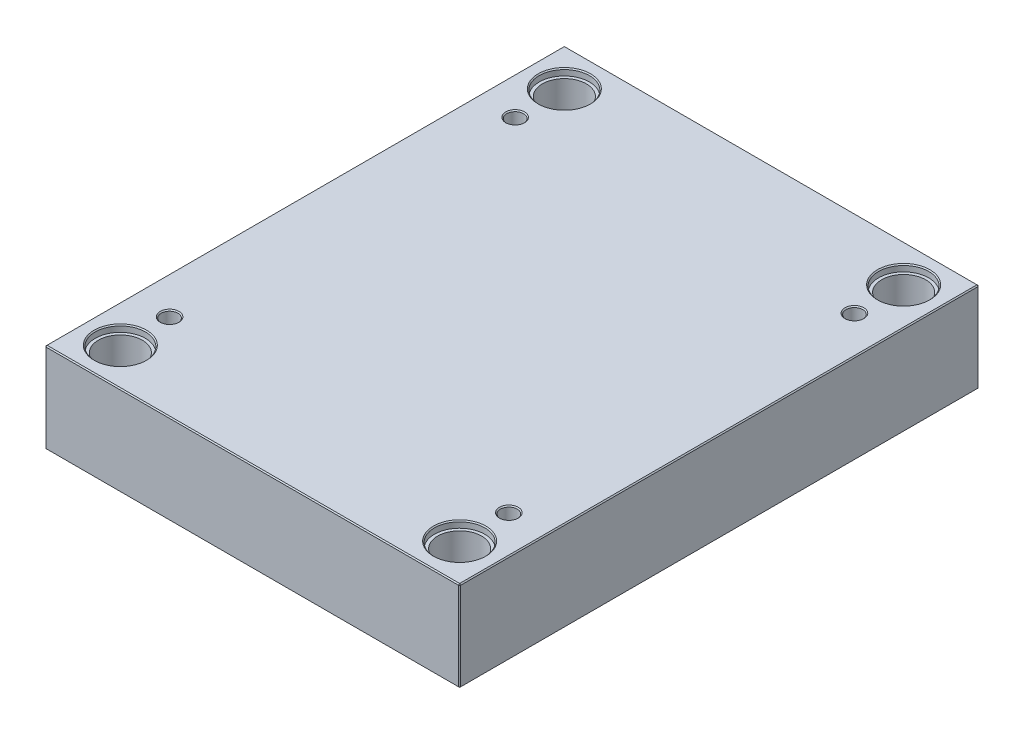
ISO-10303-21;
HEADER;
FILE_DESCRIPTION(('STEP AP214'),'2;1');
FILE_NAME('part.step','',(''),(''),'','','');
FILE_SCHEMA(('AUTOMOTIVE_DESIGN { 1 0 10303 214 1 1 1 1 }'));
ENDSEC;
DATA;
#1=APPLICATION_CONTEXT('core data for automotive mechanical design processes');
#2=APPLICATION_PROTOCOL_DEFINITION('international standard','automotive_design',2000,#1);
#3=PRODUCT_CONTEXT('',#1,'mechanical');
#4=PRODUCT('Part','Part','',(#3));
#5=PRODUCT_RELATED_PRODUCT_CATEGORY('part','',(#4));
#6=PRODUCT_DEFINITION_FORMATION('','',#4);
#7=PRODUCT_DEFINITION_CONTEXT('part definition',#1,'design');
#8=PRODUCT_DEFINITION('design','',#6,#7);
#9=PRODUCT_DEFINITION_SHAPE('','',#8);
#10=(LENGTH_UNIT() NAMED_UNIT(*) SI_UNIT(.MILLI.,.METRE.));
#11=(NAMED_UNIT(*) PLANE_ANGLE_UNIT() SI_UNIT($,.RADIAN.));
#12=(NAMED_UNIT(*) SI_UNIT($,.STERADIAN.) SOLID_ANGLE_UNIT());
#13=UNCERTAINTY_MEASURE_WITH_UNIT(LENGTH_MEASURE(1.E-05),#10,'distance_accuracy_value','');
#14=(GEOMETRIC_REPRESENTATION_CONTEXT(3) GLOBAL_UNCERTAINTY_ASSIGNED_CONTEXT((#13)) GLOBAL_UNIT_ASSIGNED_CONTEXT((#10,
#11,#12)) REPRESENTATION_CONTEXT('',''));
#15=CARTESIAN_POINT('',(0.,0.,0.));
#16=DIRECTION('',(0.,0.,1.));
#17=DIRECTION('',(1.,0.,0.));
#18=AXIS2_PLACEMENT_3D('',#15,#16,#17);
#19=CARTESIAN_POINT('',(-162.,0.,-212.));
#20=DIRECTION('',(0.,1.,0.));
#21=DIRECTION('',(0.,0.,1.));
#22=AXIS2_PLACEMENT_3D('',#19,#20,#21);
#23=CYLINDRICAL_SURFACE('',#22,21.);
#24=CARTESIAN_POINT('',(-162.,1.00000000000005,-212.));
#25=DIRECTION('',(0.,1.,0.));
#26=DIRECTION('',(0.,0.,1.));
#27=AXIS2_PLACEMENT_3D('',#24,#25,#26);
#28=CIRCLE('',#27,21.);
#29=CARTESIAN_POINT('',(-162.,1.00000000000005,-191.));
#30=VERTEX_POINT('',#29);
#31=EDGE_CURVE('E472',#30,#30,#28,.F.);
#32=ORIENTED_EDGE('',*,*,#31,.T.);
#33=EDGE_LOOP('',(#32));
#34=FACE_BOUND('',#33,.T.);
#35=CARTESIAN_POINT('',(-162.,79.7,-212.));
#36=DIRECTION('',(0.,1.,0.));
#37=DIRECTION('',(0.,0.,1.));
#38=AXIS2_PLACEMENT_3D('',#35,#36,#37);
#39=CIRCLE('',#38,21.);
#40=CARTESIAN_POINT('',(-162.,79.7,-191.));
#41=VERTEX_POINT('',#40);
#42=EDGE_CURVE('E221',#41,#41,#39,.F.);
#43=ORIENTED_EDGE('',*,*,#42,.F.);
#44=EDGE_LOOP('',(#43));
#45=FACE_BOUND('',#44,.T.);
#46=ADVANCED_FACE('F16',(#34,#45),#23,.F.);
#47=CARTESIAN_POINT('',(162.,0.,-212.));
#48=DIRECTION('',(0.,1.,0.));
#49=DIRECTION('',(0.,0.,1.));
#50=AXIS2_PLACEMENT_3D('',#47,#48,#49);
#51=CYLINDRICAL_SURFACE('',#50,21.);
#52=CARTESIAN_POINT('',(162.,1.00000000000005,-212.));
#53=DIRECTION('',(0.,1.,0.));
#54=DIRECTION('',(0.,0.,1.));
#55=AXIS2_PLACEMENT_3D('',#52,#53,#54);
#56=CIRCLE('',#55,21.);
#57=CARTESIAN_POINT('',(162.,1.00000000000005,-191.));
#58=VERTEX_POINT('',#57);
#59=EDGE_CURVE('E474',#58,#58,#56,.F.);
#60=ORIENTED_EDGE('',*,*,#59,.T.);
#61=EDGE_LOOP('',(#60));
#62=FACE_BOUND('',#61,.T.);
#63=CARTESIAN_POINT('',(162.,79.7,-212.));
#64=DIRECTION('',(0.,1.,0.));
#65=DIRECTION('',(0.,0.,1.));
#66=AXIS2_PLACEMENT_3D('',#63,#64,#65);
#67=CIRCLE('',#66,21.);
#68=CARTESIAN_POINT('',(162.,79.7,-191.));
#69=VERTEX_POINT('',#68);
#70=EDGE_CURVE('E218',#69,#69,#67,.F.);
#71=ORIENTED_EDGE('',*,*,#70,.F.);
#72=EDGE_LOOP('',(#71));
#73=FACE_BOUND('',#72,.T.);
#74=ADVANCED_FACE('F263',(#62,#73),#51,.F.);
#75=CARTESIAN_POINT('',(162.,0.,212.));
#76=DIRECTION('',(0.,1.,0.));
#77=DIRECTION('',(0.,0.,1.));
#78=AXIS2_PLACEMENT_3D('',#75,#76,#77);
#79=CYLINDRICAL_SURFACE('',#78,21.);
#80=CARTESIAN_POINT('',(162.,1.00000000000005,212.));
#81=DIRECTION('',(0.,1.,0.));
#82=DIRECTION('',(0.,0.,1.));
#83=AXIS2_PLACEMENT_3D('',#80,#81,#82);
#84=CIRCLE('',#83,21.);
#85=CARTESIAN_POINT('',(162.,1.00000000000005,233.));
#86=VERTEX_POINT('',#85);
#87=EDGE_CURVE('E477',#86,#86,#84,.F.);
#88=ORIENTED_EDGE('',*,*,#87,.T.);
#89=EDGE_LOOP('',(#88));
#90=FACE_BOUND('',#89,.T.);
#91=CARTESIAN_POINT('',(162.,79.7,212.));
#92=DIRECTION('',(0.,1.,0.));
#93=DIRECTION('',(0.,0.,1.));
#94=AXIS2_PLACEMENT_3D('',#91,#92,#93);
#95=CIRCLE('',#94,21.);
#96=CARTESIAN_POINT('',(162.,79.7,233.));
#97=VERTEX_POINT('',#96);
#98=EDGE_CURVE('E214',#97,#97,#95,.F.);
#99=ORIENTED_EDGE('',*,*,#98,.F.);
#100=EDGE_LOOP('',(#99));
#101=FACE_BOUND('',#100,.T.);
#102=ADVANCED_FACE('F270',(#90,#101),#79,.F.);
#103=CARTESIAN_POINT('',(-162.,0.,212.));
#104=DIRECTION('',(0.,1.,0.));
#105=DIRECTION('',(0.,0.,1.));
#106=AXIS2_PLACEMENT_3D('',#103,#104,#105);
#107=CYLINDRICAL_SURFACE('',#106,21.);
#108=CARTESIAN_POINT('',(-162.,1.00000000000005,212.));
#109=DIRECTION('',(0.,1.,0.));
#110=DIRECTION('',(0.,0.,1.));
#111=AXIS2_PLACEMENT_3D('',#108,#109,#110);
#112=CIRCLE('',#111,21.);
#113=CARTESIAN_POINT('',(-162.,1.00000000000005,233.));
#114=VERTEX_POINT('',#113);
#115=EDGE_CURVE('E480',#114,#114,#112,.F.);
#116=ORIENTED_EDGE('',*,*,#115,.T.);
#117=EDGE_LOOP('',(#116));
#118=FACE_BOUND('',#117,.T.);
#119=CARTESIAN_POINT('',(-162.,79.7,212.));
#120=DIRECTION('',(0.,1.,0.));
#121=DIRECTION('',(0.,0.,1.));
#122=AXIS2_PLACEMENT_3D('',#119,#120,#121);
#123=CIRCLE('',#122,21.);
#124=CARTESIAN_POINT('',(-162.,79.7,233.));
#125=VERTEX_POINT('',#124);
#126=EDGE_CURVE('E211',#125,#125,#123,.F.);
#127=ORIENTED_EDGE('',*,*,#126,.F.);
#128=EDGE_LOOP('',(#127));
#129=FACE_BOUND('',#128,.T.);
#130=ADVANCED_FACE('F277',(#118,#129),#107,.F.);
#131=CARTESIAN_POINT('',(-198.,86.,248.));
#132=DIRECTION('',(1.,0.,0.));
#133=DIRECTION('',(0.,0.,-1.));
#134=AXIS2_PLACEMENT_3D('',#131,#132,#133);
#135=PLANE('',#134);
#136=DIRECTION('',(0.,-1.,0.));
#137=VECTOR('',#136,1.);
#138=CARTESIAN_POINT('',(-198.,86.,-247.));
#139=LINE('',#138,#137);
#140=CARTESIAN_POINT('',(-198.,85.,-247.));
#141=VERTEX_POINT('',#140);
#142=CARTESIAN_POINT('',(-198.,1.00000000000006,-247.));
#143=VERTEX_POINT('',#142);
#144=EDGE_CURVE('E487',#141,#143,#139,.T.);
#145=ORIENTED_EDGE('',*,*,#144,.T.);
#146=DIRECTION('',(0.,0.,1.));
#147=VECTOR('',#146,1.);
#148=CARTESIAN_POINT('',(-198.,1.00000000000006,248.));
#149=LINE('',#148,#147);
#150=CARTESIAN_POINT('',(-198.,1.00000000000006,247.));
#151=VERTEX_POINT('',#150);
#152=EDGE_CURVE('E490',#143,#151,#149,.T.);
#153=ORIENTED_EDGE('',*,*,#152,.T.);
#154=DIRECTION('',(0.,1.,0.));
#155=VECTOR('',#154,1.);
#156=CARTESIAN_POINT('',(-198.,86.,247.));
#157=LINE('',#156,#155);
#158=CARTESIAN_POINT('',(-198.,85.,247.));
#159=VERTEX_POINT('',#158);
#160=EDGE_CURVE('E485',#151,#159,#157,.T.);
#161=ORIENTED_EDGE('',*,*,#160,.T.);
#162=DIRECTION('',(0.,0.,-1.));
#163=VECTOR('',#162,1.);
#164=CARTESIAN_POINT('',(-198.,85.,-248.));
#165=LINE('',#164,#163);
#166=EDGE_CURVE('E483',#159,#141,#165,.T.);
#167=ORIENTED_EDGE('',*,*,#166,.T.);
#168=EDGE_LOOP('',(#145,#153,#161,#167));
#169=FACE_BOUND('',#168,.T.);
#170=ADVANCED_FACE('F298',(#169),#135,.F.);
#171=CARTESIAN_POINT('',(198.,86.,248.));
#172=DIRECTION('',(0.,0.,-1.));
#173=DIRECTION('',(-1.,0.,0.));
#174=AXIS2_PLACEMENT_3D('',#171,#172,#173);
#175=PLANE('',#174);
#176=DIRECTION('',(-1.,0.,0.));
#177=VECTOR('',#176,1.);
#178=CARTESIAN_POINT('',(-198.,85.,248.));
#179=LINE('',#178,#177);
#180=CARTESIAN_POINT('',(197.,85.,248.));
#181=VERTEX_POINT('',#180);
#182=CARTESIAN_POINT('',(-197.,85.,248.));
#183=VERTEX_POINT('',#182);
#184=EDGE_CURVE('E509',#181,#183,#179,.T.);
#185=ORIENTED_EDGE('',*,*,#184,.T.);
#186=DIRECTION('',(0.,-1.,0.));
#187=VECTOR('',#186,1.);
#188=CARTESIAN_POINT('',(-197.,86.,248.));
#189=LINE('',#188,#187);
#190=CARTESIAN_POINT('',(-197.,1.,248.));
#191=VERTEX_POINT('',#190);
#192=EDGE_CURVE('E515',#183,#191,#189,.T.);
#193=ORIENTED_EDGE('',*,*,#192,.T.);
#194=DIRECTION('',(1.,0.,0.));
#195=VECTOR('',#194,1.);
#196=CARTESIAN_POINT('',(198.,1.,248.));
#197=LINE('',#196,#195);
#198=CARTESIAN_POINT('',(197.,1.,248.));
#199=VERTEX_POINT('',#198);
#200=EDGE_CURVE('E513',#191,#199,#197,.T.);
#201=ORIENTED_EDGE('',*,*,#200,.T.);
#202=DIRECTION('',(0.,1.,0.));
#203=VECTOR('',#202,1.);
#204=CARTESIAN_POINT('',(197.,86.,248.));
#205=LINE('',#204,#203);
#206=EDGE_CURVE('E511',#199,#181,#205,.T.);
#207=ORIENTED_EDGE('',*,*,#206,.T.);
#208=EDGE_LOOP('',(#185,#193,#201,#207));
#209=FACE_BOUND('',#208,.T.);
#210=ADVANCED_FACE('F294',(#209),#175,.F.);
#211=CARTESIAN_POINT('',(198.,86.,248.));
#212=DIRECTION('',(-1.,0.,0.));
#213=DIRECTION('',(0.,0.,1.));
#214=AXIS2_PLACEMENT_3D('',#211,#212,#213);
#215=PLANE('',#214);
#216=DIRECTION('',(0.,0.,-1.));
#217=VECTOR('',#216,1.);
#218=CARTESIAN_POINT('',(198.,1.,248.));
#219=LINE('',#218,#217);
#220=CARTESIAN_POINT('',(198.,1.,247.));
#221=VERTEX_POINT('',#220);
#222=CARTESIAN_POINT('',(198.,1.,-247.));
#223=VERTEX_POINT('',#222);
#224=EDGE_CURVE('E504',#221,#223,#219,.T.);
#225=ORIENTED_EDGE('',*,*,#224,.T.);
#226=DIRECTION('',(0.,1.,0.));
#227=VECTOR('',#226,1.);
#228=CARTESIAN_POINT('',(198.,86.,-247.));
#229=LINE('',#228,#227);
#230=CARTESIAN_POINT('',(198.,85.,-247.));
#231=VERTEX_POINT('',#230);
#232=EDGE_CURVE('E506',#223,#231,#229,.T.);
#233=ORIENTED_EDGE('',*,*,#232,.T.);
#234=DIRECTION('',(0.,0.,1.));
#235=VECTOR('',#234,1.);
#236=CARTESIAN_POINT('',(198.,85.,248.));
#237=LINE('',#236,#235);
#238=CARTESIAN_POINT('',(198.,85.,247.));
#239=VERTEX_POINT('',#238);
#240=EDGE_CURVE('E500',#231,#239,#237,.T.);
#241=ORIENTED_EDGE('',*,*,#240,.T.);
#242=DIRECTION('',(0.,-1.,0.));
#243=VECTOR('',#242,1.);
#244=CARTESIAN_POINT('',(198.,86.,247.));
#245=LINE('',#244,#243);
#246=EDGE_CURVE('E502',#239,#221,#245,.T.);
#247=ORIENTED_EDGE('',*,*,#246,.T.);
#248=EDGE_LOOP('',(#225,#233,#241,#247));
#249=FACE_BOUND('',#248,.T.);
#250=ADVANCED_FACE('F290',(#249),#215,.F.);
#251=CARTESIAN_POINT('',(198.,86.,-248.));
#252=DIRECTION('',(0.,0.,1.));
#253=DIRECTION('',(1.,0.,0.));
#254=AXIS2_PLACEMENT_3D('',#251,#252,#253);
#255=PLANE('',#254);
#256=DIRECTION('',(0.,-1.,0.));
#257=VECTOR('',#256,1.);
#258=CARTESIAN_POINT('',(197.,86.,-248.));
#259=LINE('',#258,#257);
#260=CARTESIAN_POINT('',(197.,85.,-248.));
#261=VERTEX_POINT('',#260);
#262=CARTESIAN_POINT('',(197.,1.,-248.));
#263=VERTEX_POINT('',#262);
#264=EDGE_CURVE('E494',#261,#263,#259,.T.);
#265=ORIENTED_EDGE('',*,*,#264,.T.);
#266=DIRECTION('',(-1.,0.,0.));
#267=VECTOR('',#266,1.);
#268=CARTESIAN_POINT('',(198.,1.,-248.));
#269=LINE('',#268,#267);
#270=CARTESIAN_POINT('',(-197.,1.,-248.));
#271=VERTEX_POINT('',#270);
#272=EDGE_CURVE('E138',#263,#271,#269,.T.);
#273=ORIENTED_EDGE('',*,*,#272,.T.);
#274=DIRECTION('',(0.,1.,0.));
#275=VECTOR('',#274,1.);
#276=CARTESIAN_POINT('',(-197.,86.,-248.));
#277=LINE('',#276,#275);
#278=CARTESIAN_POINT('',(-197.,85.,-248.));
#279=VERTEX_POINT('',#278);
#280=EDGE_CURVE('E496',#271,#279,#277,.T.);
#281=ORIENTED_EDGE('',*,*,#280,.T.);
#282=DIRECTION('',(1.,0.,0.));
#283=VECTOR('',#282,1.);
#284=CARTESIAN_POINT('',(198.,85.,-248.));
#285=LINE('',#284,#283);
#286=EDGE_CURVE('E492',#279,#261,#285,.T.);
#287=ORIENTED_EDGE('',*,*,#286,.T.);
#288=EDGE_LOOP('',(#265,#273,#281,#287));
#289=FACE_BOUND('',#288,.T.);
#290=ADVANCED_FACE('F282',(#289),#255,.F.);
#291=CARTESIAN_POINT('',(0.,86.,0.));
#292=DIRECTION('',(0.,1.,0.));
#293=DIRECTION('',(0.,0.,1.));
#294=AXIS2_PLACEMENT_3D('',#291,#292,#293);
#295=PLANE('',#294);
#296=CARTESIAN_POINT('',(162.,86.,212.));
#297=DIRECTION('',(0.,1.,0.));
#298=DIRECTION('',(0.,0.,1.));
#299=AXIS2_PLACEMENT_3D('',#296,#297,#298);
#300=CIRCLE('',#299,25.);
#301=CARTESIAN_POINT('',(162.,86.,237.));
#302=VERTEX_POINT('',#301);
#303=EDGE_CURVE('E236',#302,#302,#300,.F.);
#304=ORIENTED_EDGE('',*,*,#303,.T.);
#305=EDGE_LOOP('',(#304));
#306=FACE_BOUND('',#305,.T.);
#307=CARTESIAN_POINT('',(-162.,86.,212.));
#308=DIRECTION('',(0.,1.,0.));
#309=DIRECTION('',(0.,0.,1.));
#310=AXIS2_PLACEMENT_3D('',#307,#308,#309);
#311=CIRCLE('',#310,25.);
#312=CARTESIAN_POINT('',(-162.,86.,237.));
#313=VERTEX_POINT('',#312);
#314=EDGE_CURVE('E233',#313,#313,#311,.F.);
#315=ORIENTED_EDGE('',*,*,#314,.T.);
#316=EDGE_LOOP('',(#315));
#317=FACE_BOUND('',#316,.T.);
#318=CARTESIAN_POINT('',(162.,86.,-212.));
#319=DIRECTION('',(0.,1.,0.));
#320=DIRECTION('',(0.,0.,1.));
#321=AXIS2_PLACEMENT_3D('',#318,#319,#320);
#322=CIRCLE('',#321,25.);
#323=CARTESIAN_POINT('',(162.,86.,-187.));
#324=VERTEX_POINT('',#323);
#325=EDGE_CURVE('E230',#324,#324,#322,.F.);
#326=ORIENTED_EDGE('',*,*,#325,.T.);
#327=EDGE_LOOP('',(#326));
#328=FACE_BOUND('',#327,.T.);
#329=CARTESIAN_POINT('',(-162.,86.,-212.));
#330=DIRECTION('',(0.,1.,0.));
#331=DIRECTION('',(0.,0.,1.));
#332=AXIS2_PLACEMENT_3D('',#329,#330,#331);
#333=CIRCLE('',#332,25.);
#334=CARTESIAN_POINT('',(-162.,86.,-187.));
#335=VERTEX_POINT('',#334);
#336=EDGE_CURVE('E227',#335,#335,#333,.F.);
#337=ORIENTED_EDGE('',*,*,#336,.T.);
#338=EDGE_LOOP('',(#337));
#339=FACE_BOUND('',#338,.T.);
#340=CARTESIAN_POINT('',(-162.,86.,165.));
#341=DIRECTION('',(0.,1.,0.));
#342=DIRECTION('',(0.,0.,1.));
#343=AXIS2_PLACEMENT_3D('',#340,#341,#342);
#344=CIRCLE('',#343,9.);
#345=CARTESIAN_POINT('',(-162.,86.,174.));
#346=VERTEX_POINT('',#345);
#347=EDGE_CURVE('E198',#346,#346,#344,.F.);
#348=ORIENTED_EDGE('',*,*,#347,.T.);
#349=EDGE_LOOP('',(#348));
#350=FACE_BOUND('',#349,.T.);
#351=CARTESIAN_POINT('',(162.,86.,165.));
#352=DIRECTION('',(0.,1.,0.));
#353=DIRECTION('',(0.,0.,1.));
#354=AXIS2_PLACEMENT_3D('',#351,#352,#353);
#355=CIRCLE('',#354,9.);
#356=CARTESIAN_POINT('',(162.,86.,174.));
#357=VERTEX_POINT('',#356);
#358=EDGE_CURVE('E195',#357,#357,#355,.F.);
#359=ORIENTED_EDGE('',*,*,#358,.T.);
#360=EDGE_LOOP('',(#359));
#361=FACE_BOUND('',#360,.T.);
#362=CARTESIAN_POINT('',(162.,86.,-165.));
#363=DIRECTION('',(0.,1.,0.));
#364=DIRECTION('',(0.,0.,1.));
#365=AXIS2_PLACEMENT_3D('',#362,#363,#364);
#366=CIRCLE('',#365,9.);
#367=CARTESIAN_POINT('',(162.,86.,-156.));
#368=VERTEX_POINT('',#367);
#369=EDGE_CURVE('E192',#368,#368,#366,.F.);
#370=ORIENTED_EDGE('',*,*,#369,.T.);
#371=EDGE_LOOP('',(#370));
#372=FACE_BOUND('',#371,.T.);
#373=CARTESIAN_POINT('',(-162.,86.,-165.));
#374=DIRECTION('',(0.,1.,0.));
#375=DIRECTION('',(0.,0.,1.));
#376=AXIS2_PLACEMENT_3D('',#373,#374,#375);
#377=CIRCLE('',#376,9.);
#378=CARTESIAN_POINT('',(-162.,86.,-156.));
#379=VERTEX_POINT('',#378);
#380=EDGE_CURVE('E188',#379,#379,#377,.F.);
#381=ORIENTED_EDGE('',*,*,#380,.T.);
#382=EDGE_LOOP('',(#381));
#383=FACE_BOUND('',#382,.T.);
#384=DIRECTION('',(0.,0.,-1.));
#385=VECTOR('',#384,1.);
#386=CARTESIAN_POINT('',(197.,86.,-248.));
#387=LINE('',#386,#385);
#388=CARTESIAN_POINT('',(197.,86.,247.));
#389=VERTEX_POINT('',#388);
#390=CARTESIAN_POINT('',(197.,86.,-247.));
#391=VERTEX_POINT('',#390);
#392=EDGE_CURVE('E31',#389,#391,#387,.T.);
#393=ORIENTED_EDGE('',*,*,#392,.T.);
#394=DIRECTION('',(-1.,0.,0.));
#395=VECTOR('',#394,1.);
#396=CARTESIAN_POINT('',(-198.,86.,-247.));
#397=LINE('',#396,#395);
#398=CARTESIAN_POINT('',(-197.,86.,-247.));
#399=VERTEX_POINT('',#398);
#400=EDGE_CURVE('E189',#391,#399,#397,.T.);
#401=ORIENTED_EDGE('',*,*,#400,.T.);
#402=DIRECTION('',(0.,0.,1.));
#403=VECTOR('',#402,1.);
#404=CARTESIAN_POINT('',(-197.,86.,248.));
#405=LINE('',#404,#403);
#406=CARTESIAN_POINT('',(-197.,86.,247.));
#407=VERTEX_POINT('',#406);
#408=EDGE_CURVE('E518',#399,#407,#405,.T.);
#409=ORIENTED_EDGE('',*,*,#408,.T.);
#410=DIRECTION('',(1.,0.,0.));
#411=VECTOR('',#410,1.);
#412=CARTESIAN_POINT('',(198.,86.,247.));
#413=LINE('',#412,#411);
#414=EDGE_CURVE('E36',#407,#389,#413,.T.);
#415=ORIENTED_EDGE('',*,*,#414,.T.);
#416=EDGE_LOOP('',(#393,#401,#409,#415));
#417=FACE_BOUND('',#416,.T.);
#418=ADVANCED_FACE('F279',(#306,#317,#328,#339,#350,#361,#372,#383,#417),#295,.T.);
#419=CARTESIAN_POINT('',(0.,0.,0.));
#420=DIRECTION('',(0.,1.,0.));
#421=DIRECTION('',(0.,0.,1.));
#422=AXIS2_PLACEMENT_3D('',#419,#420,#421);
#423=PLANE('',#422);
#424=CARTESIAN_POINT('',(-162.,0.,-212.));
#425=DIRECTION('',(0.,1.,0.));
#426=DIRECTION('',(0.,0.,1.));
#427=AXIS2_PLACEMENT_3D('',#424,#425,#426);
#428=CIRCLE('',#427,22.);
#429=CARTESIAN_POINT('',(-162.,0.,-190.));
#430=VERTEX_POINT('',#429);
#431=EDGE_CURVE('E469',#430,#430,#428,.T.);
#432=ORIENTED_EDGE('',*,*,#431,.T.);
#433=EDGE_LOOP('',(#432));
#434=FACE_BOUND('',#433,.T.);
#435=CARTESIAN_POINT('',(162.,0.,-212.));
#436=DIRECTION('',(0.,1.,0.));
#437=DIRECTION('',(0.,0.,1.));
#438=AXIS2_PLACEMENT_3D('',#435,#436,#437);
#439=CIRCLE('',#438,22.);
#440=CARTESIAN_POINT('',(162.,0.,-190.));
#441=VERTEX_POINT('',#440);
#442=EDGE_CURVE('E466',#441,#441,#439,.T.);
#443=ORIENTED_EDGE('',*,*,#442,.T.);
#444=EDGE_LOOP('',(#443));
#445=FACE_BOUND('',#444,.T.);
#446=CARTESIAN_POINT('',(162.,0.,212.));
#447=DIRECTION('',(0.,1.,0.));
#448=DIRECTION('',(0.,0.,1.));
#449=AXIS2_PLACEMENT_3D('',#446,#447,#448);
#450=CIRCLE('',#449,22.);
#451=CARTESIAN_POINT('',(162.,0.,234.));
#452=VERTEX_POINT('',#451);
#453=EDGE_CURVE('E463',#452,#452,#450,.T.);
#454=ORIENTED_EDGE('',*,*,#453,.T.);
#455=EDGE_LOOP('',(#454));
#456=FACE_BOUND('',#455,.T.);
#457=CARTESIAN_POINT('',(-162.,0.,212.));
#458=DIRECTION('',(0.,1.,0.));
#459=DIRECTION('',(0.,0.,1.));
#460=AXIS2_PLACEMENT_3D('',#457,#458,#459);
#461=CIRCLE('',#460,22.);
#462=CARTESIAN_POINT('',(-162.,0.,234.));
#463=VERTEX_POINT('',#462);
#464=EDGE_CURVE('E460',#463,#463,#461,.T.);
#465=ORIENTED_EDGE('',*,*,#464,.T.);
#466=EDGE_LOOP('',(#465));
#467=FACE_BOUND('',#466,.T.);
#468=DIRECTION('',(0.,0.,1.));
#469=VECTOR('',#468,1.);
#470=CARTESIAN_POINT('',(197.,0.,0.));
#471=LINE('',#470,#469);
#472=CARTESIAN_POINT('',(197.,0.,-247.));
#473=VERTEX_POINT('',#472);
#474=CARTESIAN_POINT('',(197.,0.,247.));
#475=VERTEX_POINT('',#474);
#476=EDGE_CURVE('E108',#473,#475,#471,.T.);
#477=ORIENTED_EDGE('',*,*,#476,.T.);
#478=DIRECTION('',(-1.,0.,0.));
#479=VECTOR('',#478,1.);
#480=CARTESIAN_POINT('',(0.,0.,247.));
#481=LINE('',#480,#479);
#482=CARTESIAN_POINT('',(-197.,0.,247.));
#483=VERTEX_POINT('',#482);
#484=EDGE_CURVE('E458',#475,#483,#481,.T.);
#485=ORIENTED_EDGE('',*,*,#484,.T.);
#486=DIRECTION('',(0.,0.,-1.));
#487=VECTOR('',#486,1.);
#488=CARTESIAN_POINT('',(-197.,0.,0.));
#489=LINE('',#488,#487);
#490=CARTESIAN_POINT('',(-197.,0.,-247.));
#491=VERTEX_POINT('',#490);
#492=EDGE_CURVE('E110',#483,#491,#489,.T.);
#493=ORIENTED_EDGE('',*,*,#492,.T.);
#494=DIRECTION('',(1.,0.,0.));
#495=VECTOR('',#494,1.);
#496=CARTESIAN_POINT('',(0.,0.,-247.));
#497=LINE('',#496,#495);
#498=EDGE_CURVE('E104',#491,#473,#497,.T.);
#499=ORIENTED_EDGE('',*,*,#498,.T.);
#500=EDGE_LOOP('',(#477,#485,#493,#499));
#501=FACE_BOUND('',#500,.T.);
#502=ADVANCED_FACE('F106',(#434,#445,#456,#467,#501),#423,.F.);
#503=CARTESIAN_POINT('',(-162.,0.,-212.));
#504=DIRECTION('',(0.,-1.,0.));
#505=DIRECTION('',(0.,0.,-1.));
#506=AXIS2_PLACEMENT_3D('',#503,#504,#505);
#507=CONICAL_SURFACE('',#506,22.,0.785398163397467);
#508=ORIENTED_EDGE('',*,*,#31,.F.);
#509=EDGE_LOOP('',(#508));
#510=FACE_BOUND('',#509,.T.);
#511=ORIENTED_EDGE('',*,*,#431,.F.);
#512=EDGE_LOOP('',(#511));
#513=FACE_BOUND('',#512,.T.);
#514=ADVANCED_FACE('F286',(#510,#513),#507,.F.);
#515=CARTESIAN_POINT('',(162.,0.,-212.));
#516=DIRECTION('',(0.,-1.,0.));
#517=DIRECTION('',(0.,0.,-1.));
#518=AXIS2_PLACEMENT_3D('',#515,#516,#517);
#519=CONICAL_SURFACE('',#518,22.,0.785398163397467);
#520=ORIENTED_EDGE('',*,*,#59,.F.);
#521=EDGE_LOOP('',(#520));
#522=FACE_BOUND('',#521,.T.);
#523=ORIENTED_EDGE('',*,*,#442,.F.);
#524=EDGE_LOOP('',(#523));
#525=FACE_BOUND('',#524,.T.);
#526=ADVANCED_FACE('F305',(#522,#525),#519,.F.);
#527=CARTESIAN_POINT('',(162.,0.,212.));
#528=DIRECTION('',(0.,-1.,0.));
#529=DIRECTION('',(0.,0.,-1.));
#530=AXIS2_PLACEMENT_3D('',#527,#528,#529);
#531=CONICAL_SURFACE('',#530,22.,0.785398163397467);
#532=ORIENTED_EDGE('',*,*,#87,.F.);
#533=EDGE_LOOP('',(#532));
#534=FACE_BOUND('',#533,.T.);
#535=ORIENTED_EDGE('',*,*,#453,.F.);
#536=EDGE_LOOP('',(#535));
#537=FACE_BOUND('',#536,.T.);
#538=ADVANCED_FACE('F309',(#534,#537),#531,.F.);
#539=CARTESIAN_POINT('',(-162.,0.,212.));
#540=DIRECTION('',(0.,-1.,0.));
#541=DIRECTION('',(0.,0.,-1.));
#542=AXIS2_PLACEMENT_3D('',#539,#540,#541);
#543=CONICAL_SURFACE('',#542,22.,0.785398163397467);
#544=ORIENTED_EDGE('',*,*,#115,.F.);
#545=EDGE_LOOP('',(#544));
#546=FACE_BOUND('',#545,.T.);
#547=ORIENTED_EDGE('',*,*,#464,.F.);
#548=EDGE_LOOP('',(#547));
#549=FACE_BOUND('',#548,.T.);
#550=ADVANCED_FACE('F313',(#546,#549),#543,.F.);
#551=CARTESIAN_POINT('',(198.,86.,247.));
#552=DIRECTION('',(-0.707106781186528,0.,-0.707106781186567));
#553=DIRECTION('',(0.,-1.,0.));
#554=AXIS2_PLACEMENT_3D('',#551,#552,#553);
#555=PLANE('',#554);
#556=DIRECTION('',(-0.707106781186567,0.,0.707106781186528));
#557=VECTOR('',#556,1.);
#558=CARTESIAN_POINT('',(197.,85.,248.));
#559=LINE('',#558,#557);
#560=EDGE_CURVE('E126',#181,#239,#559,.F.);
#561=ORIENTED_EDGE('',*,*,#560,.F.);
#562=ORIENTED_EDGE('',*,*,#206,.F.);
#563=DIRECTION('',(0.707106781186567,0.,-0.707106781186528));
#564=VECTOR('',#563,1.);
#565=CARTESIAN_POINT('',(197.,1.,248.));
#566=LINE('',#565,#564);
#567=EDGE_CURVE('E180',#221,#199,#566,.F.);
#568=ORIENTED_EDGE('',*,*,#567,.F.);
#569=ORIENTED_EDGE('',*,*,#246,.F.);
#570=EDGE_LOOP('',(#561,#562,#568,#569));
#571=FACE_BOUND('',#570,.T.);
#572=ADVANCED_FACE('F317',(#571),#555,.F.);
#573=CARTESIAN_POINT('',(197.,85.,248.));
#574=DIRECTION('',(0.577350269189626,0.577350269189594,0.577350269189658));
#575=DIRECTION('',(0.707106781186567,0.,-0.707106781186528));
#576=AXIS2_PLACEMENT_3D('',#573,#574,#575);
#577=PLANE('',#576);
#578=DIRECTION('',(0.,-0.707106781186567,0.707106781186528));
#579=VECTOR('',#578,1.);
#580=CARTESIAN_POINT('',(197.,85.,248.));
#581=LINE('',#580,#579);
#582=EDGE_CURVE('E175',#181,#389,#581,.F.);
#583=ORIENTED_EDGE('',*,*,#582,.F.);
#584=ORIENTED_EDGE('',*,*,#560,.T.);
#585=DIRECTION('',(-0.707106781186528,0.707106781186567,0.));
#586=VECTOR('',#585,1.);
#587=CARTESIAN_POINT('',(197.5,85.5,247.));
#588=LINE('',#587,#586);
#589=EDGE_CURVE('E177',#389,#239,#588,.F.);
#590=ORIENTED_EDGE('',*,*,#589,.F.);
#591=EDGE_LOOP('',(#583,#584,#590));
#592=FACE_BOUND('',#591,.T.);
#593=ADVANCED_FACE('F385',(#592),#577,.T.);
#594=CARTESIAN_POINT('',(197.,1.,248.));
#595=DIRECTION('',(0.577350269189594,-0.577350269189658,0.577350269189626));
#596=DIRECTION('',(0.,-0.707106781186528,-0.707106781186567));
#597=AXIS2_PLACEMENT_3D('',#594,#595,#596);
#598=PLANE('',#597);
#599=DIRECTION('',(-0.707106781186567,-0.707106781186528,0.));
#600=VECTOR('',#599,1.);
#601=CARTESIAN_POINT('',(197.5,0.5,247.));
#602=LINE('',#601,#600);
#603=EDGE_CURVE('E124',#221,#475,#602,.T.);
#604=ORIENTED_EDGE('',*,*,#603,.F.);
#605=ORIENTED_EDGE('',*,*,#567,.T.);
#606=DIRECTION('',(0.,0.707106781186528,0.707106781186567));
#607=VECTOR('',#606,1.);
#608=CARTESIAN_POINT('',(197.,1.,248.));
#609=LINE('',#608,#607);
#610=EDGE_CURVE('E172',#475,#199,#609,.T.);
#611=ORIENTED_EDGE('',*,*,#610,.F.);
#612=EDGE_LOOP('',(#604,#605,#611));
#613=FACE_BOUND('',#612,.T.);
#614=ADVANCED_FACE('F381',(#613),#598,.T.);
#615=CARTESIAN_POINT('',(197.,86.,0.));
#616=DIRECTION('',(0.707106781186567,0.707106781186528,0.));
#617=DIRECTION('',(0.,0.,1.));
#618=AXIS2_PLACEMENT_3D('',#615,#616,#617);
#619=PLANE('',#618);
#620=ORIENTED_EDGE('',*,*,#589,.T.);
#621=ORIENTED_EDGE('',*,*,#240,.F.);
#622=DIRECTION('',(0.707106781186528,-0.707106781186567,0.));
#623=VECTOR('',#622,1.);
#624=CARTESIAN_POINT('',(198.,85.,-247.));
#625=LINE('',#624,#623);
#626=EDGE_CURVE('E166',#391,#231,#625,.T.);
#627=ORIENTED_EDGE('',*,*,#626,.F.);
#628=ORIENTED_EDGE('',*,*,#392,.F.);
#629=EDGE_LOOP('',(#620,#621,#627,#628));
#630=FACE_BOUND('',#629,.T.);
#631=ADVANCED_FACE('F377',(#630),#619,.T.);
#632=CARTESIAN_POINT('',(0.,86.,247.));
#633=DIRECTION('',(0.,0.707106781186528,0.707106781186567));
#634=DIRECTION('',(-1.,0.,0.));
#635=AXIS2_PLACEMENT_3D('',#632,#633,#634);
#636=PLANE('',#635);
#637=ORIENTED_EDGE('',*,*,#582,.T.);
#638=ORIENTED_EDGE('',*,*,#414,.F.);
#639=DIRECTION('',(0.,0.707106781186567,-0.707106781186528));
#640=VECTOR('',#639,1.);
#641=CARTESIAN_POINT('',(-197.,85.5,247.5));
#642=LINE('',#641,#640);
#643=EDGE_CURVE('E163',#183,#407,#642,.T.);
#644=ORIENTED_EDGE('',*,*,#643,.F.);
#645=ORIENTED_EDGE('',*,*,#184,.F.);
#646=EDGE_LOOP('',(#637,#638,#644,#645));
#647=FACE_BOUND('',#646,.T.);
#648=ADVANCED_FACE('F373',(#647),#636,.T.);
#649=CARTESIAN_POINT('',(-197.,86.,248.));
#650=DIRECTION('',(0.707106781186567,0.,-0.707106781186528));
#651=DIRECTION('',(0.,-1.,0.));
#652=AXIS2_PLACEMENT_3D('',#649,#650,#651);
#653=PLANE('',#652);
#654=DIRECTION('',(0.707106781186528,0.,0.707106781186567));
#655=VECTOR('',#654,1.);
#656=CARTESIAN_POINT('',(-197.,1.,248.));
#657=LINE('',#656,#655);
#658=EDGE_CURVE('E157',#191,#151,#657,.F.);
#659=ORIENTED_EDGE('',*,*,#658,.F.);
#660=ORIENTED_EDGE('',*,*,#192,.F.);
#661=DIRECTION('',(-0.707106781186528,0.,-0.707106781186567));
#662=VECTOR('',#661,1.);
#663=CARTESIAN_POINT('',(-198.,85.,247.));
#664=LINE('',#663,#662);
#665=EDGE_CURVE('E160',#159,#183,#664,.F.);
#666=ORIENTED_EDGE('',*,*,#665,.F.);
#667=ORIENTED_EDGE('',*,*,#160,.F.);
#668=EDGE_LOOP('',(#659,#660,#666,#667));
#669=FACE_BOUND('',#668,.T.);
#670=ADVANCED_FACE('F369',(#669),#653,.F.);
#671=CARTESIAN_POINT('',(198.,1.,248.));
#672=DIRECTION('',(0.,0.707106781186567,-0.707106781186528));
#673=DIRECTION('',(1.,0.,0.));
#674=AXIS2_PLACEMENT_3D('',#671,#672,#673);
#675=PLANE('',#674);
#676=ORIENTED_EDGE('',*,*,#610,.T.);
#677=ORIENTED_EDGE('',*,*,#200,.F.);
#678=DIRECTION('',(0.,-0.707106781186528,-0.707106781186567));
#679=VECTOR('',#678,1.);
#680=CARTESIAN_POINT('',(-197.,1.,248.));
#681=LINE('',#680,#679);
#682=EDGE_CURVE('E135',#483,#191,#681,.F.);
#683=ORIENTED_EDGE('',*,*,#682,.F.);
#684=ORIENTED_EDGE('',*,*,#484,.F.);
#685=EDGE_LOOP('',(#676,#677,#683,#684));
#686=FACE_BOUND('',#685,.T.);
#687=ADVANCED_FACE('F366',(#686),#675,.F.);
#688=CARTESIAN_POINT('',(198.,1.,248.));
#689=DIRECTION('',(-0.707106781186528,0.707106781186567,0.));
#690=DIRECTION('',(0.,0.,-1.));
#691=AXIS2_PLACEMENT_3D('',#688,#689,#690);
#692=PLANE('',#691);
#693=ORIENTED_EDGE('',*,*,#603,.T.);
#694=ORIENTED_EDGE('',*,*,#476,.F.);
#695=DIRECTION('',(0.707106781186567,0.707106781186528,0.));
#696=VECTOR('',#695,1.);
#697=CARTESIAN_POINT('',(197.5,0.499999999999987,-247.));
#698=LINE('',#697,#696);
#699=EDGE_CURVE('E121',#223,#473,#698,.F.);
#700=ORIENTED_EDGE('',*,*,#699,.F.);
#701=ORIENTED_EDGE('',*,*,#224,.F.);
#702=EDGE_LOOP('',(#693,#694,#700,#701));
#703=FACE_BOUND('',#702,.T.);
#704=ADVANCED_FACE('F119',(#703),#692,.F.);
#705=CARTESIAN_POINT('',(197.,86.,-248.));
#706=DIRECTION('',(-0.707106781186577,0.,0.707106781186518));
#707=DIRECTION('',(0.,-1.,0.));
#708=AXIS2_PLACEMENT_3D('',#705,#706,#707);
#709=PLANE('',#708);
#710=DIRECTION('',(0.707106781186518,0.,0.707106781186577));
#711=VECTOR('',#710,1.);
#712=CARTESIAN_POINT('',(198.,85.,-247.));
#713=LINE('',#712,#711);
#714=EDGE_CURVE('E168',#231,#261,#713,.F.);
#715=ORIENTED_EDGE('',*,*,#714,.F.);
#716=ORIENTED_EDGE('',*,*,#232,.F.);
#717=DIRECTION('',(-0.707106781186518,0.,-0.707106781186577));
#718=VECTOR('',#717,1.);
#719=CARTESIAN_POINT('',(197.,1.,-248.));
#720=LINE('',#719,#718);
#721=EDGE_CURVE('E134',#263,#223,#720,.F.);
#722=ORIENTED_EDGE('',*,*,#721,.F.);
#723=ORIENTED_EDGE('',*,*,#264,.F.);
#724=EDGE_LOOP('',(#715,#716,#722,#723));
#725=FACE_BOUND('',#724,.T.);
#726=ADVANCED_FACE('F359',(#725),#709,.F.);
#727=CARTESIAN_POINT('',(198.,85.,-247.));
#728=DIRECTION('',(0.577350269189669,0.577350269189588,-0.57735026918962));
#729=DIRECTION('',(-0.707106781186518,0.,-0.707106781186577));
#730=AXIS2_PLACEMENT_3D('',#727,#728,#729);
#731=PLANE('',#730);
#732=ORIENTED_EDGE('',*,*,#626,.T.);
#733=ORIENTED_EDGE('',*,*,#714,.T.);
#734=DIRECTION('',(0.,0.707106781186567,0.707106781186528));
#735=VECTOR('',#734,1.);
#736=CARTESIAN_POINT('',(197.,85.5,-247.5));
#737=LINE('',#736,#735);
#738=EDGE_CURVE('E152',#391,#261,#737,.F.);
#739=ORIENTED_EDGE('',*,*,#738,.F.);
#740=EDGE_LOOP('',(#732,#733,#739));
#741=FACE_BOUND('',#740,.T.);
#742=ADVANCED_FACE('F355',(#741),#731,.T.);
#743=CARTESIAN_POINT('',(-198.,85.,247.));
#744=DIRECTION('',(-0.577350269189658,0.577350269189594,0.577350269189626));
#745=DIRECTION('',(0.707106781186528,0.,0.707106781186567));
#746=AXIS2_PLACEMENT_3D('',#743,#744,#745);
#747=PLANE('',#746);
#748=ORIENTED_EDGE('',*,*,#665,.T.);
#749=ORIENTED_EDGE('',*,*,#643,.T.);
#750=DIRECTION('',(-0.707106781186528,-0.707106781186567,0.));
#751=VECTOR('',#750,1.);
#752=CARTESIAN_POINT('',(-198.,85.,247.));
#753=LINE('',#752,#751);
#754=EDGE_CURVE('E143',#159,#407,#753,.F.);
#755=ORIENTED_EDGE('',*,*,#754,.F.);
#756=EDGE_LOOP('',(#748,#749,#755));
#757=FACE_BOUND('',#756,.T.);
#758=ADVANCED_FACE('F351',(#757),#747,.T.);
#759=CARTESIAN_POINT('',(-197.,1.,248.));
#760=DIRECTION('',(-0.577350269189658,-0.577350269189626,0.577350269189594));
#761=DIRECTION('',(0.707106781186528,-0.707106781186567,0.));
#762=AXIS2_PLACEMENT_3D('',#759,#760,#761);
#763=PLANE('',#762);
#764=ORIENTED_EDGE('',*,*,#682,.T.);
#765=ORIENTED_EDGE('',*,*,#658,.T.);
#766=DIRECTION('',(-0.707106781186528,0.707106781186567,0.));
#767=VECTOR('',#766,1.);
#768=CARTESIAN_POINT('',(-197.5,0.500000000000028,247.));
#769=LINE('',#768,#767);
#770=EDGE_CURVE('E139',#483,#151,#769,.T.);
#771=ORIENTED_EDGE('',*,*,#770,.F.);
#772=EDGE_LOOP('',(#764,#765,#771));
#773=FACE_BOUND('',#772,.T.);
#774=ADVANCED_FACE('F348',(#773),#763,.T.);
#775=CARTESIAN_POINT('',(197.,1.,-248.));
#776=DIRECTION('',(0.577350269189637,-0.577350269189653,-0.577350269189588));
#777=DIRECTION('',(0.707106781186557,0.707106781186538,0.));
#778=AXIS2_PLACEMENT_3D('',#775,#776,#777);
#779=PLANE('',#778);
#780=ORIENTED_EDGE('',*,*,#721,.T.);
#781=ORIENTED_EDGE('',*,*,#699,.T.);
#782=DIRECTION('',(0.,-0.707106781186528,0.707106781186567));
#783=VECTOR('',#782,1.);
#784=CARTESIAN_POINT('',(197.,1.,-248.));
#785=LINE('',#784,#783);
#786=EDGE_CURVE('E131',#263,#473,#785,.T.);
#787=ORIENTED_EDGE('',*,*,#786,.F.);
#788=EDGE_LOOP('',(#780,#781,#787));
#789=FACE_BOUND('',#788,.T.);
#790=ADVANCED_FACE('F130',(#789),#779,.T.);
#791=CARTESIAN_POINT('',(0.,86.,-247.));
#792=DIRECTION('',(0.,0.707106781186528,-0.707106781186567));
#793=DIRECTION('',(1.,0.,0.));
#794=AXIS2_PLACEMENT_3D('',#791,#792,#793);
#795=PLANE('',#794);
#796=ORIENTED_EDGE('',*,*,#738,.T.);
#797=ORIENTED_EDGE('',*,*,#286,.F.);
#798=DIRECTION('',(0.,-0.707106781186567,-0.707106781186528));
#799=VECTOR('',#798,1.);
#800=CARTESIAN_POINT('',(-197.,85.,-248.));
#801=LINE('',#800,#799);
#802=EDGE_CURVE('E140',#399,#279,#801,.T.);
#803=ORIENTED_EDGE('',*,*,#802,.F.);
#804=ORIENTED_EDGE('',*,*,#400,.F.);
#805=EDGE_LOOP('',(#796,#797,#803,#804));
#806=FACE_BOUND('',#805,.T.);
#807=ADVANCED_FACE('F341',(#806),#795,.T.);
#808=CARTESIAN_POINT('',(-197.,86.,0.));
#809=DIRECTION('',(-0.707106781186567,0.707106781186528,0.));
#810=DIRECTION('',(0.,0.,-1.));
#811=AXIS2_PLACEMENT_3D('',#808,#809,#810);
#812=PLANE('',#811);
#813=ORIENTED_EDGE('',*,*,#754,.T.);
#814=ORIENTED_EDGE('',*,*,#408,.F.);
#815=DIRECTION('',(0.707106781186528,0.707106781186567,0.));
#816=VECTOR('',#815,1.);
#817=CARTESIAN_POINT('',(-197.5,85.5,-247.));
#818=LINE('',#817,#816);
#819=EDGE_CURVE('E146',#141,#399,#818,.T.);
#820=ORIENTED_EDGE('',*,*,#819,.F.);
#821=ORIENTED_EDGE('',*,*,#166,.F.);
#822=EDGE_LOOP('',(#813,#814,#820,#821));
#823=FACE_BOUND('',#822,.T.);
#824=ADVANCED_FACE('F337',(#823),#812,.T.);
#825=CARTESIAN_POINT('',(-198.,1.00000000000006,248.));
#826=DIRECTION('',(0.707106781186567,0.707106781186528,0.));
#827=DIRECTION('',(0.,0.,1.));
#828=AXIS2_PLACEMENT_3D('',#825,#826,#827);
#829=PLANE('',#828);
#830=ORIENTED_EDGE('',*,*,#770,.T.);
#831=ORIENTED_EDGE('',*,*,#152,.F.);
#832=DIRECTION('',(0.707106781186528,-0.707106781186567,0.));
#833=VECTOR('',#832,1.);
#834=CARTESIAN_POINT('',(-198.,1.00000000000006,-247.));
#835=LINE('',#834,#833);
#836=EDGE_CURVE('E529',#491,#143,#835,.F.);
#837=ORIENTED_EDGE('',*,*,#836,.F.);
#838=ORIENTED_EDGE('',*,*,#492,.F.);
#839=EDGE_LOOP('',(#830,#831,#837,#838));
#840=FACE_BOUND('',#839,.T.);
#841=ADVANCED_FACE('F334',(#840),#829,.F.);
#842=CARTESIAN_POINT('',(198.,1.,-248.));
#843=DIRECTION('',(0.,0.707106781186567,0.707106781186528));
#844=DIRECTION('',(-1.,0.,0.));
#845=AXIS2_PLACEMENT_3D('',#842,#843,#844);
#846=PLANE('',#845);
#847=ORIENTED_EDGE('',*,*,#786,.T.);
#848=ORIENTED_EDGE('',*,*,#498,.F.);
#849=DIRECTION('',(0.,0.707106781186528,-0.707106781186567));
#850=VECTOR('',#849,1.);
#851=CARTESIAN_POINT('',(-197.,0.500000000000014,-247.5));
#852=LINE('',#851,#850);
#853=EDGE_CURVE('E526',#271,#491,#852,.F.);
#854=ORIENTED_EDGE('',*,*,#853,.F.);
#855=ORIENTED_EDGE('',*,*,#272,.F.);
#856=EDGE_LOOP('',(#847,#848,#854,#855));
#857=FACE_BOUND('',#856,.T.);
#858=ADVANCED_FACE('F137',(#857),#846,.F.);
#859=CARTESIAN_POINT('',(-197.,85.,-248.));
#860=DIRECTION('',(-0.577350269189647,0.577350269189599,-0.577350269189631));
#861=DIRECTION('',(-0.707106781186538,0.,0.707106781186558));
#862=AXIS2_PLACEMENT_3D('',#859,#860,#861);
#863=PLANE('',#862);
#864=ORIENTED_EDGE('',*,*,#819,.T.);
#865=ORIENTED_EDGE('',*,*,#802,.T.);
#866=DIRECTION('',(0.707106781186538,0.,-0.707106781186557));
#867=VECTOR('',#866,1.);
#868=CARTESIAN_POINT('',(-197.,85.,-248.));
#869=LINE('',#868,#867);
#870=EDGE_CURVE('E524',#141,#279,#869,.T.);
#871=ORIENTED_EDGE('',*,*,#870,.F.);
#872=EDGE_LOOP('',(#864,#865,#871));
#873=FACE_BOUND('',#872,.T.);
#874=ADVANCED_FACE('F327',(#873),#863,.T.);
#875=CARTESIAN_POINT('',(-198.,1.00000000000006,-247.));
#876=DIRECTION('',(-0.577350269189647,-0.577350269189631,-0.577350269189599));
#877=DIRECTION('',(0.707106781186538,-0.707106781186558,0.));
#878=AXIS2_PLACEMENT_3D('',#875,#876,#877);
#879=PLANE('',#878);
#880=ORIENTED_EDGE('',*,*,#853,.T.);
#881=ORIENTED_EDGE('',*,*,#836,.T.);
#882=DIRECTION('',(-0.707106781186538,0.,0.707106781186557));
#883=VECTOR('',#882,1.);
#884=CARTESIAN_POINT('',(-198.,1.00000000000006,-247.));
#885=LINE('',#884,#883);
#886=EDGE_CURVE('E455',#271,#143,#885,.T.);
#887=ORIENTED_EDGE('',*,*,#886,.F.);
#888=EDGE_LOOP('',(#880,#881,#887));
#889=FACE_BOUND('',#888,.T.);
#890=ADVANCED_FACE('F323',(#889),#879,.T.);
#891=CARTESIAN_POINT('',(-198.,86.,-247.));
#892=DIRECTION('',(0.707106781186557,0.,0.707106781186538));
#893=DIRECTION('',(0.,-1.,0.));
#894=AXIS2_PLACEMENT_3D('',#891,#892,#893);
#895=PLANE('',#894);
#896=ORIENTED_EDGE('',*,*,#870,.T.);
#897=ORIENTED_EDGE('',*,*,#280,.F.);
#898=ORIENTED_EDGE('',*,*,#886,.T.);
#899=ORIENTED_EDGE('',*,*,#144,.F.);
#900=EDGE_LOOP('',(#896,#897,#898,#899));
#901=FACE_BOUND('',#900,.T.);
#902=ADVANCED_FACE('F319',(#901),#895,.F.);
#903=CARTESIAN_POINT('',(-162.,61.,-165.));
#904=DIRECTION('',(0.,1.,0.));
#905=DIRECTION('',(0.,0.,1.));
#906=AXIS2_PLACEMENT_3D('',#903,#904,#905);
#907=CYLINDRICAL_SURFACE('',#906,8.);
#908=CARTESIAN_POINT('',(-162.,85.,-165.));
#909=DIRECTION('',(0.,1.,0.));
#910=DIRECTION('',(0.,0.,1.));
#911=AXIS2_PLACEMENT_3D('',#908,#909,#910);
#912=CIRCLE('',#911,8.);
#913=CARTESIAN_POINT('',(-162.,85.,-157.));
#914=VERTEX_POINT('',#913);
#915=EDGE_CURVE('E207',#914,#914,#912,.T.);
#916=ORIENTED_EDGE('',*,*,#915,.T.);
#917=EDGE_LOOP('',(#916));
#918=FACE_BOUND('',#917,.T.);
#919=CARTESIAN_POINT('',(-162.,61.,-165.));
#920=DIRECTION('',(0.,1.,0.));
#921=DIRECTION('',(0.,0.,1.));
#922=AXIS2_PLACEMENT_3D('',#919,#920,#921);
#923=CIRCLE('',#922,8.);
#924=CARTESIAN_POINT('',(-162.,61.,-157.));
#925=VERTEX_POINT('',#924);
#926=EDGE_CURVE('E448',#925,#925,#923,.T.);
#927=ORIENTED_EDGE('',*,*,#926,.F.);
#928=EDGE_LOOP('',(#927));
#929=FACE_BOUND('',#928,.T.);
#930=ADVANCED_FACE('F322',(#918,#929),#907,.F.);
#931=CARTESIAN_POINT('',(-162.,61.,-165.));
#932=DIRECTION('',(0.,1.,0.));
#933=DIRECTION('',(0.,0.,1.));
#934=AXIS2_PLACEMENT_3D('',#931,#932,#933);
#935=PLANE('',#934);
#936=ORIENTED_EDGE('',*,*,#926,.T.);
#937=EDGE_LOOP('',(#936));
#938=FACE_BOUND('',#937,.T.);
#939=ADVANCED_FACE('F596',(#938),#935,.T.);
#940=CARTESIAN_POINT('',(162.,61.,-165.));
#941=DIRECTION('',(0.,1.,0.));
#942=DIRECTION('',(0.,0.,1.));
#943=AXIS2_PLACEMENT_3D('',#940,#941,#942);
#944=CYLINDRICAL_SURFACE('',#943,8.);
#945=CARTESIAN_POINT('',(162.,85.,-165.));
#946=DIRECTION('',(0.,1.,0.));
#947=DIRECTION('',(0.,0.,1.));
#948=AXIS2_PLACEMENT_3D('',#945,#946,#947);
#949=CIRCLE('',#948,8.);
#950=CARTESIAN_POINT('',(162.,85.,-157.));
#951=VERTEX_POINT('',#950);
#952=EDGE_CURVE('E204',#951,#951,#949,.T.);
#953=ORIENTED_EDGE('',*,*,#952,.T.);
#954=EDGE_LOOP('',(#953));
#955=FACE_BOUND('',#954,.T.);
#956=CARTESIAN_POINT('',(162.,61.,-165.));
#957=DIRECTION('',(0.,1.,0.));
#958=DIRECTION('',(0.,0.,1.));
#959=AXIS2_PLACEMENT_3D('',#956,#957,#958);
#960=CIRCLE('',#959,8.);
#961=CARTESIAN_POINT('',(162.,61.,-157.));
#962=VERTEX_POINT('',#961);
#963=EDGE_CURVE('E445',#962,#962,#960,.T.);
#964=ORIENTED_EDGE('',*,*,#963,.F.);
#965=EDGE_LOOP('',(#964));
#966=FACE_BOUND('',#965,.T.);
#967=ADVANCED_FACE('F592',(#955,#966),#944,.F.);
#968=CARTESIAN_POINT('',(162.,61.,-165.));
#969=DIRECTION('',(0.,1.,0.));
#970=DIRECTION('',(0.,0.,1.));
#971=AXIS2_PLACEMENT_3D('',#968,#969,#970);
#972=PLANE('',#971);
#973=ORIENTED_EDGE('',*,*,#963,.T.);
#974=EDGE_LOOP('',(#973));
#975=FACE_BOUND('',#974,.T.);
#976=ADVANCED_FACE('F588',(#975),#972,.T.);
#977=CARTESIAN_POINT('',(162.,61.,165.));
#978=DIRECTION('',(0.,1.,0.));
#979=DIRECTION('',(0.,0.,1.));
#980=AXIS2_PLACEMENT_3D('',#977,#978,#979);
#981=CYLINDRICAL_SURFACE('',#980,8.);
#982=CARTESIAN_POINT('',(162.,85.,165.));
#983=DIRECTION('',(0.,1.,0.));
#984=DIRECTION('',(0.,0.,1.));
#985=AXIS2_PLACEMENT_3D('',#982,#983,#984);
#986=CIRCLE('',#985,8.);
#987=CARTESIAN_POINT('',(162.,85.,173.));
#988=VERTEX_POINT('',#987);
#989=EDGE_CURVE('E201',#988,#988,#986,.T.);
#990=ORIENTED_EDGE('',*,*,#989,.T.);
#991=EDGE_LOOP('',(#990));
#992=FACE_BOUND('',#991,.T.);
#993=CARTESIAN_POINT('',(162.,61.,165.));
#994=DIRECTION('',(0.,1.,0.));
#995=DIRECTION('',(0.,0.,1.));
#996=AXIS2_PLACEMENT_3D('',#993,#994,#995);
#997=CIRCLE('',#996,8.);
#998=CARTESIAN_POINT('',(162.,61.,173.));
#999=VERTEX_POINT('',#998);
#1000=EDGE_CURVE('E449',#999,#999,#997,.T.);
#1001=ORIENTED_EDGE('',*,*,#1000,.F.);
#1002=EDGE_LOOP('',(#1001));
#1003=FACE_BOUND('',#1002,.T.);
#1004=ADVANCED_FACE('F591',(#992,#1003),#981,.F.);
#1005=CARTESIAN_POINT('',(162.,61.,165.));
#1006=DIRECTION('',(0.,1.,0.));
#1007=DIRECTION('',(0.,0.,1.));
#1008=AXIS2_PLACEMENT_3D('',#1005,#1006,#1007);
#1009=PLANE('',#1008);
#1010=ORIENTED_EDGE('',*,*,#1000,.T.);
#1011=EDGE_LOOP('',(#1010));
#1012=FACE_BOUND('',#1011,.T.);
#1013=ADVANCED_FACE('F598',(#1012),#1009,.T.);
#1014=CARTESIAN_POINT('',(-162.,61.,165.));
#1015=DIRECTION('',(0.,1.,0.));
#1016=DIRECTION('',(0.,0.,1.));
#1017=AXIS2_PLACEMENT_3D('',#1014,#1015,#1016);
#1018=CYLINDRICAL_SURFACE('',#1017,8.);
#1019=CARTESIAN_POINT('',(-162.,85.,165.));
#1020=DIRECTION('',(0.,1.,0.));
#1021=DIRECTION('',(0.,0.,1.));
#1022=AXIS2_PLACEMENT_3D('',#1019,#1020,#1021);
#1023=CIRCLE('',#1022,8.);
#1024=CARTESIAN_POINT('',(-162.,85.,173.));
#1025=VERTEX_POINT('',#1024);
#1026=EDGE_CURVE('E185',#1025,#1025,#1023,.T.);
#1027=ORIENTED_EDGE('',*,*,#1026,.T.);
#1028=EDGE_LOOP('',(#1027));
#1029=FACE_BOUND('',#1028,.T.);
#1030=CARTESIAN_POINT('',(-162.,61.,165.));
#1031=DIRECTION('',(0.,1.,0.));
#1032=DIRECTION('',(0.,0.,1.));
#1033=AXIS2_PLACEMENT_3D('',#1030,#1031,#1032);
#1034=CIRCLE('',#1033,8.);
#1035=CARTESIAN_POINT('',(-162.,61.,173.));
#1036=VERTEX_POINT('',#1035);
#1037=EDGE_CURVE('E224',#1036,#1036,#1034,.T.);
#1038=ORIENTED_EDGE('',*,*,#1037,.F.);
#1039=EDGE_LOOP('',(#1038));
#1040=FACE_BOUND('',#1039,.T.);
#1041=ADVANCED_FACE('F601',(#1029,#1040),#1018,.F.);
#1042=CARTESIAN_POINT('',(-162.,61.,165.));
#1043=DIRECTION('',(0.,1.,0.));
#1044=DIRECTION('',(0.,0.,1.));
#1045=AXIS2_PLACEMENT_3D('',#1042,#1043,#1044);
#1046=PLANE('',#1045);
#1047=ORIENTED_EDGE('',*,*,#1037,.T.);
#1048=EDGE_LOOP('',(#1047));
#1049=FACE_BOUND('',#1048,.T.);
#1050=ADVANCED_FACE('F397',(#1049),#1046,.T.);
#1051=CARTESIAN_POINT('',(-162.,85.,165.));
#1052=DIRECTION('',(0.,1.,0.));
#1053=DIRECTION('',(0.,0.,1.));
#1054=AXIS2_PLACEMENT_3D('',#1051,#1052,#1053);
#1055=CONICAL_SURFACE('',#1054,8.,0.785398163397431);
#1056=ORIENTED_EDGE('',*,*,#347,.F.);
#1057=EDGE_LOOP('',(#1056));
#1058=FACE_BOUND('',#1057,.T.);
#1059=ORIENTED_EDGE('',*,*,#1026,.F.);
#1060=EDGE_LOOP('',(#1059));
#1061=FACE_BOUND('',#1060,.T.);
#1062=ADVANCED_FACE('F393',(#1058,#1061),#1055,.F.);
#1063=CARTESIAN_POINT('',(162.,85.,165.));
#1064=DIRECTION('',(0.,1.,0.));
#1065=DIRECTION('',(0.,0.,1.));
#1066=AXIS2_PLACEMENT_3D('',#1063,#1064,#1065);
#1067=CONICAL_SURFACE('',#1066,8.,0.785398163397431);
#1068=ORIENTED_EDGE('',*,*,#358,.F.);
#1069=EDGE_LOOP('',(#1068));
#1070=FACE_BOUND('',#1069,.T.);
#1071=ORIENTED_EDGE('',*,*,#989,.F.);
#1072=EDGE_LOOP('',(#1071));
#1073=FACE_BOUND('',#1072,.T.);
#1074=ADVANCED_FACE('F396',(#1070,#1073),#1067,.F.);
#1075=CARTESIAN_POINT('',(162.,85.,-165.));
#1076=DIRECTION('',(0.,1.,0.));
#1077=DIRECTION('',(0.,0.,1.));
#1078=AXIS2_PLACEMENT_3D('',#1075,#1076,#1077);
#1079=CONICAL_SURFACE('',#1078,8.,0.785398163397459);
#1080=ORIENTED_EDGE('',*,*,#369,.F.);
#1081=EDGE_LOOP('',(#1080));
#1082=FACE_BOUND('',#1081,.T.);
#1083=ORIENTED_EDGE('',*,*,#952,.F.);
#1084=EDGE_LOOP('',(#1083));
#1085=FACE_BOUND('',#1084,.T.);
#1086=ADVANCED_FACE('F401',(#1082,#1085),#1079,.F.);
#1087=CARTESIAN_POINT('',(-162.,85.,-165.));
#1088=DIRECTION('',(0.,1.,0.));
#1089=DIRECTION('',(0.,0.,1.));
#1090=AXIS2_PLACEMENT_3D('',#1087,#1088,#1089);
#1091=CONICAL_SURFACE('',#1090,8.,0.785398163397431);
#1092=ORIENTED_EDGE('',*,*,#380,.F.);
#1093=EDGE_LOOP('',(#1092));
#1094=FACE_BOUND('',#1093,.T.);
#1095=ORIENTED_EDGE('',*,*,#915,.F.);
#1096=EDGE_LOOP('',(#1095));
#1097=FACE_BOUND('',#1096,.T.);
#1098=ADVANCED_FACE('F405',(#1094,#1097),#1091,.F.);
#1099=CARTESIAN_POINT('',(-162.,79.7,212.));
#1100=DIRECTION('',(0.,1.,0.));
#1101=DIRECTION('',(0.,0.,1.));
#1102=AXIS2_PLACEMENT_3D('',#1099,#1100,#1101);
#1103=PLANE('',#1102);
#1104=CARTESIAN_POINT('',(-162.,79.7,212.));
#1105=DIRECTION('',(0.,1.,0.));
#1106=DIRECTION('',(0.,0.,1.));
#1107=AXIS2_PLACEMENT_3D('',#1104,#1105,#1106);
#1108=CIRCLE('',#1107,24.);
#1109=CARTESIAN_POINT('',(-162.,79.7,236.));
#1110=VERTEX_POINT('',#1109);
#1111=EDGE_CURVE('E436',#1110,#1110,#1108,.T.);
#1112=ORIENTED_EDGE('',*,*,#1111,.T.);
#1113=EDGE_LOOP('',(#1112));
#1114=FACE_BOUND('',#1113,.T.);
#1115=ORIENTED_EDGE('',*,*,#126,.T.);
#1116=EDGE_LOOP('',(#1115));
#1117=FACE_BOUND('',#1116,.T.);
#1118=ADVANCED_FACE('F409',(#1114,#1117),#1103,.T.);
#1119=CARTESIAN_POINT('',(-162.,79.7,212.));
#1120=DIRECTION('',(0.,1.,0.));
#1121=DIRECTION('',(0.,0.,1.));
#1122=AXIS2_PLACEMENT_3D('',#1119,#1120,#1121);
#1123=CYLINDRICAL_SURFACE('',#1122,24.);
#1124=CARTESIAN_POINT('',(-162.,85.,212.));
#1125=DIRECTION('',(0.,1.,0.));
#1126=DIRECTION('',(0.,0.,1.));
#1127=AXIS2_PLACEMENT_3D('',#1124,#1125,#1126);
#1128=CIRCLE('',#1127,24.);
#1129=CARTESIAN_POINT('',(-162.,85.,236.));
#1130=VERTEX_POINT('',#1129);
#1131=EDGE_CURVE('E239',#1130,#1130,#1128,.T.);
#1132=ORIENTED_EDGE('',*,*,#1131,.T.);
#1133=EDGE_LOOP('',(#1132));
#1134=FACE_BOUND('',#1133,.T.);
#1135=ORIENTED_EDGE('',*,*,#1111,.F.);
#1136=EDGE_LOOP('',(#1135));
#1137=FACE_BOUND('',#1136,.T.);
#1138=ADVANCED_FACE('F574',(#1134,#1137),#1123,.F.);
#1139=CARTESIAN_POINT('',(162.,79.7,212.));
#1140=DIRECTION('',(0.,1.,0.));
#1141=DIRECTION('',(0.,0.,1.));
#1142=AXIS2_PLACEMENT_3D('',#1139,#1140,#1141);
#1143=PLANE('',#1142);
#1144=CARTESIAN_POINT('',(162.,79.7,212.));
#1145=DIRECTION('',(0.,1.,0.));
#1146=DIRECTION('',(0.,0.,1.));
#1147=AXIS2_PLACEMENT_3D('',#1144,#1145,#1146);
#1148=CIRCLE('',#1147,24.);
#1149=CARTESIAN_POINT('',(162.,79.7,236.));
#1150=VERTEX_POINT('',#1149);
#1151=EDGE_CURVE('E433',#1150,#1150,#1148,.T.);
#1152=ORIENTED_EDGE('',*,*,#1151,.T.);
#1153=EDGE_LOOP('',(#1152));
#1154=FACE_BOUND('',#1153,.T.);
#1155=ORIENTED_EDGE('',*,*,#98,.T.);
#1156=EDGE_LOOP('',(#1155));
#1157=FACE_BOUND('',#1156,.T.);
#1158=ADVANCED_FACE('F429',(#1154,#1157),#1143,.T.);
#1159=CARTESIAN_POINT('',(162.,79.7,212.));
#1160=DIRECTION('',(0.,1.,0.));
#1161=DIRECTION('',(0.,0.,1.));
#1162=AXIS2_PLACEMENT_3D('',#1159,#1160,#1161);
#1163=CYLINDRICAL_SURFACE('',#1162,24.);
#1164=CARTESIAN_POINT('',(162.,85.,212.));
#1165=DIRECTION('',(0.,1.,0.));
#1166=DIRECTION('',(0.,0.,1.));
#1167=AXIS2_PLACEMENT_3D('',#1164,#1165,#1166);
#1168=CIRCLE('',#1167,24.);
#1169=CARTESIAN_POINT('',(162.,85.,236.));
#1170=VERTEX_POINT('',#1169);
#1171=EDGE_CURVE('E210',#1170,#1170,#1168,.T.);
#1172=ORIENTED_EDGE('',*,*,#1171,.T.);
#1173=EDGE_LOOP('',(#1172));
#1174=FACE_BOUND('',#1173,.T.);
#1175=ORIENTED_EDGE('',*,*,#1151,.F.);
#1176=EDGE_LOOP('',(#1175));
#1177=FACE_BOUND('',#1176,.T.);
#1178=ADVANCED_FACE('F425',(#1174,#1177),#1163,.F.);
#1179=CARTESIAN_POINT('',(162.,79.7,-212.));
#1180=DIRECTION('',(0.,1.,0.));
#1181=DIRECTION('',(0.,0.,1.));
#1182=AXIS2_PLACEMENT_3D('',#1179,#1180,#1181);
#1183=PLANE('',#1182);
#1184=CARTESIAN_POINT('',(162.,79.7,-212.));
#1185=DIRECTION('',(0.,1.,0.));
#1186=DIRECTION('',(0.,0.,1.));
#1187=AXIS2_PLACEMENT_3D('',#1184,#1185,#1186);
#1188=CIRCLE('',#1187,24.);
#1189=CARTESIAN_POINT('',(162.,79.7,-188.));
#1190=VERTEX_POINT('',#1189);
#1191=EDGE_CURVE('E435',#1190,#1190,#1188,.T.);
#1192=ORIENTED_EDGE('',*,*,#1191,.T.);
#1193=EDGE_LOOP('',(#1192));
#1194=FACE_BOUND('',#1193,.T.);
#1195=ORIENTED_EDGE('',*,*,#70,.T.);
#1196=EDGE_LOOP('',(#1195));
#1197=FACE_BOUND('',#1196,.T.);
#1198=ADVANCED_FACE('F428',(#1194,#1197),#1183,.T.);
#1199=CARTESIAN_POINT('',(162.,79.7,-212.));
#1200=DIRECTION('',(0.,1.,0.));
#1201=DIRECTION('',(0.,0.,1.));
#1202=AXIS2_PLACEMENT_3D('',#1199,#1200,#1201);
#1203=CYLINDRICAL_SURFACE('',#1202,24.);
#1204=CARTESIAN_POINT('',(162.,85.,-212.));
#1205=DIRECTION('',(0.,1.,0.));
#1206=DIRECTION('',(0.,0.,1.));
#1207=AXIS2_PLACEMENT_3D('',#1204,#1205,#1206);
#1208=CIRCLE('',#1207,24.);
#1209=CARTESIAN_POINT('',(162.,85.,-188.));
#1210=VERTEX_POINT('',#1209);
#1211=EDGE_CURVE('E24',#1210,#1210,#1208,.T.);
#1212=ORIENTED_EDGE('',*,*,#1211,.T.);
#1213=EDGE_LOOP('',(#1212));
#1214=FACE_BOUND('',#1213,.T.);
#1215=ORIENTED_EDGE('',*,*,#1191,.F.);
#1216=EDGE_LOOP('',(#1215));
#1217=FACE_BOUND('',#1216,.T.);
#1218=ADVANCED_FACE('F244',(#1214,#1217),#1203,.F.);
#1219=CARTESIAN_POINT('',(-162.,79.7,-212.));
#1220=DIRECTION('',(0.,1.,0.));
#1221=DIRECTION('',(0.,0.,1.));
#1222=AXIS2_PLACEMENT_3D('',#1219,#1220,#1221);
#1223=PLANE('',#1222);
#1224=CARTESIAN_POINT('',(-162.,79.7,-212.));
#1225=DIRECTION('',(0.,1.,0.));
#1226=DIRECTION('',(0.,0.,1.));
#1227=AXIS2_PLACEMENT_3D('',#1224,#1225,#1226);
#1228=CIRCLE('',#1227,24.);
#1229=CARTESIAN_POINT('',(-162.,79.7,-188.));
#1230=VERTEX_POINT('',#1229);
#1231=EDGE_CURVE('E215',#1230,#1230,#1228,.T.);
#1232=ORIENTED_EDGE('',*,*,#1231,.T.);
#1233=EDGE_LOOP('',(#1232));
#1234=FACE_BOUND('',#1233,.T.);
#1235=ORIENTED_EDGE('',*,*,#42,.T.);
#1236=EDGE_LOOP('',(#1235));
#1237=FACE_BOUND('',#1236,.T.);
#1238=ADVANCED_FACE('F418',(#1234,#1237),#1223,.T.);
#1239=CARTESIAN_POINT('',(-162.,79.7,-212.));
#1240=DIRECTION('',(0.,1.,0.));
#1241=DIRECTION('',(0.,0.,1.));
#1242=AXIS2_PLACEMENT_3D('',#1239,#1240,#1241);
#1243=CYLINDRICAL_SURFACE('',#1242,24.);
#1244=CARTESIAN_POINT('',(-162.,85.,-212.));
#1245=DIRECTION('',(0.,1.,0.));
#1246=DIRECTION('',(0.,0.,1.));
#1247=AXIS2_PLACEMENT_3D('',#1244,#1245,#1246);
#1248=CIRCLE('',#1247,24.);
#1249=CARTESIAN_POINT('',(-162.,85.,-188.));
#1250=VERTEX_POINT('',#1249);
#1251=EDGE_CURVE('E10',#1250,#1250,#1248,.T.);
#1252=ORIENTED_EDGE('',*,*,#1251,.T.);
#1253=EDGE_LOOP('',(#1252));
#1254=FACE_BOUND('',#1253,.T.);
#1255=ORIENTED_EDGE('',*,*,#1231,.F.);
#1256=EDGE_LOOP('',(#1255));
#1257=FACE_BOUND('',#1256,.T.);
#1258=ADVANCED_FACE('F412',(#1254,#1257),#1243,.F.);
#1259=CARTESIAN_POINT('',(162.,85.,212.));
#1260=DIRECTION('',(0.,1.,0.));
#1261=DIRECTION('',(0.,0.,1.));
#1262=AXIS2_PLACEMENT_3D('',#1259,#1260,#1261);
#1263=CONICAL_SURFACE('',#1262,24.,0.785398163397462);
#1264=ORIENTED_EDGE('',*,*,#303,.F.);
#1265=EDGE_LOOP('',(#1264));
#1266=FACE_BOUND('',#1265,.T.);
#1267=ORIENTED_EDGE('',*,*,#1171,.F.);
#1268=EDGE_LOOP('',(#1267));
#1269=FACE_BOUND('',#1268,.T.);
#1270=ADVANCED_FACE('F258',(#1266,#1269),#1263,.F.);
#1271=CARTESIAN_POINT('',(-162.,85.,212.));
#1272=DIRECTION('',(0.,1.,0.));
#1273=DIRECTION('',(0.,0.,1.));
#1274=AXIS2_PLACEMENT_3D('',#1271,#1272,#1273);
#1275=CONICAL_SURFACE('',#1274,24.,0.785398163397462);
#1276=ORIENTED_EDGE('',*,*,#314,.F.);
#1277=EDGE_LOOP('',(#1276));
#1278=FACE_BOUND('',#1277,.T.);
#1279=ORIENTED_EDGE('',*,*,#1131,.F.);
#1280=EDGE_LOOP('',(#1279));
#1281=FACE_BOUND('',#1280,.T.);
#1282=ADVANCED_FACE('F249',(#1278,#1281),#1275,.F.);
#1283=CARTESIAN_POINT('',(162.,85.,-212.));
#1284=DIRECTION('',(0.,1.,0.));
#1285=DIRECTION('',(0.,0.,1.));
#1286=AXIS2_PLACEMENT_3D('',#1283,#1284,#1285);
#1287=CONICAL_SURFACE('',#1286,24.,0.785398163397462);
#1288=ORIENTED_EDGE('',*,*,#325,.F.);
#1289=EDGE_LOOP('',(#1288));
#1290=FACE_BOUND('',#1289,.T.);
#1291=ORIENTED_EDGE('',*,*,#1211,.F.);
#1292=EDGE_LOOP('',(#1291));
#1293=FACE_BOUND('',#1292,.T.);
#1294=ADVANCED_FACE('F247',(#1290,#1293),#1287,.F.);
#1295=CARTESIAN_POINT('',(-162.,85.,-212.));
#1296=DIRECTION('',(0.,1.,0.));
#1297=DIRECTION('',(0.,0.,1.));
#1298=AXIS2_PLACEMENT_3D('',#1295,#1296,#1297);
#1299=CONICAL_SURFACE('',#1298,24.,0.785398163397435);
#1300=ORIENTED_EDGE('',*,*,#336,.F.);
#1301=EDGE_LOOP('',(#1300));
#1302=FACE_BOUND('',#1301,.T.);
#1303=ORIENTED_EDGE('',*,*,#1251,.F.);
#1304=EDGE_LOOP('',(#1303));
#1305=FACE_BOUND('',#1304,.T.);
#1306=ADVANCED_FACE('F18',(#1302,#1305),#1299,.F.);
#1307=CLOSED_SHELL('',(#46,#74,#102,#130,#170,#210,#250,#290,#418,#502,#514,#526,#538,#550,#572,
#593,#614,#631,#648,#670,#687,#704,#726,#742,#758,#774,#790,#807,#824,#841,#858,#874,#890,#902,
#930,#939,#967,#976,#1004,#1013,#1041,#1050,#1062,#1074,#1086,#1098,#1118,#1138,#1158,#1178,
#1198,#1218,#1238,#1258,#1270,#1282,#1294,#1306));
#1308=MANIFOLD_SOLID_BREP('B1',#1307);
#1309=ADVANCED_BREP_SHAPE_REPRESENTATION('',(#18,#1308),#14);
#1310=SHAPE_DEFINITION_REPRESENTATION(#9,#1309);
ENDSEC;
END-ISO-10303-21;
